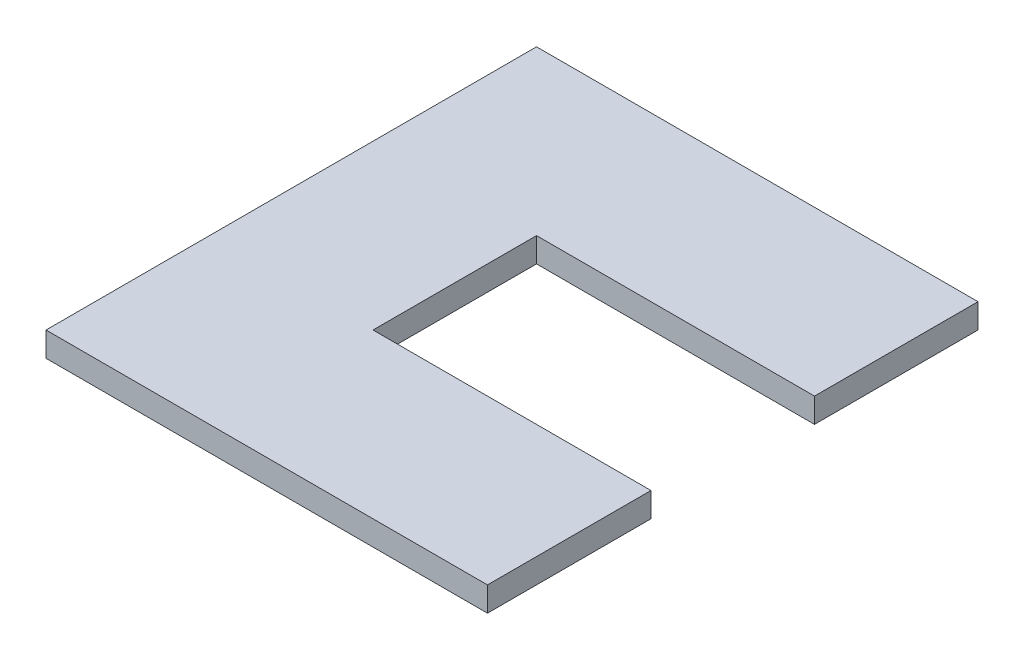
ISO-10303-21;
HEADER;
FILE_DESCRIPTION(('STEP AP214'),'2;1');
FILE_NAME('part.step','',(''),(''),'','','');
FILE_SCHEMA(('AUTOMOTIVE_DESIGN { 1 0 10303 214 1 1 1 1 }'));
ENDSEC;
DATA;
#1=APPLICATION_CONTEXT('core data for automotive mechanical design processes');
#2=APPLICATION_PROTOCOL_DEFINITION('international standard','automotive_design',2000,#1);
#3=PRODUCT_CONTEXT('',#1,'mechanical');
#4=PRODUCT('Part','Part','',(#3));
#5=PRODUCT_RELATED_PRODUCT_CATEGORY('part','',(#4));
#6=PRODUCT_DEFINITION_FORMATION('','',#4);
#7=PRODUCT_DEFINITION_CONTEXT('part definition',#1,'design');
#8=PRODUCT_DEFINITION('design','',#6,#7);
#9=PRODUCT_DEFINITION_SHAPE('','',#8);
#10=(LENGTH_UNIT() NAMED_UNIT(*) SI_UNIT(.MILLI.,.METRE.));
#11=(NAMED_UNIT(*) PLANE_ANGLE_UNIT() SI_UNIT($,.RADIAN.));
#12=(NAMED_UNIT(*) SI_UNIT($,.STERADIAN.) SOLID_ANGLE_UNIT());
#13=UNCERTAINTY_MEASURE_WITH_UNIT(LENGTH_MEASURE(1.E-05),#10,'distance_accuracy_value','');
#14=(GEOMETRIC_REPRESENTATION_CONTEXT(3) GLOBAL_UNCERTAINTY_ASSIGNED_CONTEXT((#13)) GLOBAL_UNIT_ASSIGNED_CONTEXT((#10,
#11,#12)) REPRESENTATION_CONTEXT('',''));
#15=CARTESIAN_POINT('',(0.,0.,0.));
#16=DIRECTION('',(0.,0.,1.));
#17=DIRECTION('',(1.,0.,0.));
#18=AXIS2_PLACEMENT_3D('',#15,#16,#17);
#19=CARTESIAN_POINT('',(-4.50000000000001,-0.01,-15.));
#20=DIRECTION('',(-1.,0.,0.));
#21=DIRECTION('',(0.,0.,1.));
#22=AXIS2_PLACEMENT_3D('',#19,#20,#21);
#23=PLANE('',#22);
#24=DIRECTION('',(0.,1.,0.));
#25=VECTOR('',#24,1.);
#26=CARTESIAN_POINT('',(-4.50000000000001,1.5,-15.));
#27=LINE('',#26,#25);
#28=CARTESIAN_POINT('',(-4.50000000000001,0.,-15.));
#29=VERTEX_POINT('',#28);
#30=CARTESIAN_POINT('',(-4.50000000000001,1.5,-15.));
#31=VERTEX_POINT('',#30);
#32=EDGE_CURVE('E152',#29,#31,#27,.T.);
#33=ORIENTED_EDGE('',*,*,#32,.T.);
#34=DIRECTION('',(0.,0.,1.));
#35=VECTOR('',#34,1.);
#36=CARTESIAN_POINT('',(-4.5,1.5,0.));
#37=LINE('',#36,#35);
#38=CARTESIAN_POINT('',(-4.5,1.5,-5.));
#39=VERTEX_POINT('',#38);
#40=EDGE_CURVE('E128',#31,#39,#37,.T.);
#41=ORIENTED_EDGE('',*,*,#40,.T.);
#42=DIRECTION('',(0.,1.,0.));
#43=VECTOR('',#42,1.);
#44=CARTESIAN_POINT('',(-4.5,-0.01,-5.));
#45=LINE('',#44,#43);
#46=CARTESIAN_POINT('',(-4.5,0.,-5.));
#47=VERTEX_POINT('',#46);
#48=EDGE_CURVE('E139',#47,#39,#45,.T.);
#49=ORIENTED_EDGE('',*,*,#48,.F.);
#50=DIRECTION('',(0.,0.,1.));
#51=VECTOR('',#50,1.);
#52=CARTESIAN_POINT('',(-4.5,0.,0.));
#53=LINE('',#52,#51);
#54=EDGE_CURVE('E112',#29,#47,#53,.T.);
#55=ORIENTED_EDGE('',*,*,#54,.F.);
#56=EDGE_LOOP('',(#33,#41,#49,#55));
#57=FACE_BOUND('',#56,.T.);
#58=ADVANCED_FACE('F35',(#57),#23,.F.);
#59=CARTESIAN_POINT('',(-4.5,-0.01,15.));
#60=DIRECTION('',(-1.,0.,0.));
#61=DIRECTION('',(0.,0.,1.));
#62=AXIS2_PLACEMENT_3D('',#59,#60,#61);
#63=PLANE('',#62);
#64=DIRECTION('',(0.,1.,0.));
#65=VECTOR('',#64,1.);
#66=CARTESIAN_POINT('',(-4.5,-0.01,5.));
#67=LINE('',#66,#65);
#68=CARTESIAN_POINT('',(-4.5,0.,5.));
#69=VERTEX_POINT('',#68);
#70=CARTESIAN_POINT('',(-4.5,1.5,5.));
#71=VERTEX_POINT('',#70);
#72=EDGE_CURVE('E39',#69,#71,#67,.T.);
#73=ORIENTED_EDGE('',*,*,#72,.T.);
#74=DIRECTION('',(0.,0.,1.));
#75=VECTOR('',#74,1.);
#76=CARTESIAN_POINT('',(-4.5,1.5,0.));
#77=LINE('',#76,#75);
#78=CARTESIAN_POINT('',(-4.5,1.5,15.));
#79=VERTEX_POINT('',#78);
#80=EDGE_CURVE('E126',#71,#79,#77,.T.);
#81=ORIENTED_EDGE('',*,*,#80,.T.);
#82=DIRECTION('',(0.,1.,0.));
#83=VECTOR('',#82,1.);
#84=CARTESIAN_POINT('',(-4.5,1.5,15.));
#85=LINE('',#84,#83);
#86=CARTESIAN_POINT('',(-4.5,0.,15.));
#87=VERTEX_POINT('',#86);
#88=EDGE_CURVE('E110',#87,#79,#85,.T.);
#89=ORIENTED_EDGE('',*,*,#88,.F.);
#90=DIRECTION('',(0.,0.,1.));
#91=VECTOR('',#90,1.);
#92=CARTESIAN_POINT('',(-4.5,0.,0.));
#93=LINE('',#92,#91);
#94=EDGE_CURVE('E72',#69,#87,#93,.T.);
#95=ORIENTED_EDGE('',*,*,#94,.F.);
#96=EDGE_LOOP('',(#73,#81,#89,#95));
#97=FACE_BOUND('',#96,.T.);
#98=ADVANCED_FACE('F107',(#97),#63,.F.);
#99=CARTESIAN_POINT('',(-21.5,-0.01,-5.));
#100=DIRECTION('',(0.,0.,1.));
#101=DIRECTION('',(1.,0.,0.));
#102=AXIS2_PLACEMENT_3D('',#99,#100,#101);
#103=PLANE('',#102);
#104=DIRECTION('',(0.,1.,0.));
#105=VECTOR('',#104,1.);
#106=CARTESIAN_POINT('',(-21.5,-0.01,-5.));
#107=LINE('',#106,#105);
#108=CARTESIAN_POINT('',(-21.5,0.,-5.));
#109=VERTEX_POINT('',#108);
#110=CARTESIAN_POINT('',(-21.5,1.5,-5.));
#111=VERTEX_POINT('',#110);
#112=EDGE_CURVE('E11',#109,#111,#107,.T.);
#113=ORIENTED_EDGE('',*,*,#112,.F.);
#114=DIRECTION('',(1.,0.,0.));
#115=VECTOR('',#114,1.);
#116=CARTESIAN_POINT('',(0.,0.,-5.));
#117=LINE('',#116,#115);
#118=EDGE_CURVE('E120',#109,#47,#117,.T.);
#119=ORIENTED_EDGE('',*,*,#118,.T.);
#120=ORIENTED_EDGE('',*,*,#48,.T.);
#121=DIRECTION('',(1.,0.,0.));
#122=VECTOR('',#121,1.);
#123=CARTESIAN_POINT('',(0.,1.5,-5.));
#124=LINE('',#123,#122);
#125=EDGE_CURVE('E136',#111,#39,#124,.T.);
#126=ORIENTED_EDGE('',*,*,#125,.F.);
#127=EDGE_LOOP('',(#113,#119,#120,#126));
#128=FACE_BOUND('',#127,.T.);
#129=ADVANCED_FACE('F168',(#128),#103,.T.);
#130=CARTESIAN_POINT('',(-21.5,-0.01,5.));
#131=DIRECTION('',(1.,0.,0.));
#132=DIRECTION('',(0.,0.,-1.));
#133=AXIS2_PLACEMENT_3D('',#130,#131,#132);
#134=PLANE('',#133);
#135=DIRECTION('',(0.,1.,0.));
#136=VECTOR('',#135,1.);
#137=CARTESIAN_POINT('',(-21.5,-0.01,5.));
#138=LINE('',#137,#136);
#139=CARTESIAN_POINT('',(-21.5,0.,5.));
#140=VERTEX_POINT('',#139);
#141=CARTESIAN_POINT('',(-21.5,1.5,5.));
#142=VERTEX_POINT('',#141);
#143=EDGE_CURVE('E45',#140,#142,#138,.T.);
#144=ORIENTED_EDGE('',*,*,#143,.F.);
#145=DIRECTION('',(0.,0.,-1.));
#146=VECTOR('',#145,1.);
#147=CARTESIAN_POINT('',(-21.5,0.,0.));
#148=LINE('',#147,#146);
#149=EDGE_CURVE('E125',#140,#109,#148,.T.);
#150=ORIENTED_EDGE('',*,*,#149,.T.);
#151=ORIENTED_EDGE('',*,*,#112,.T.);
#152=DIRECTION('',(0.,0.,-1.));
#153=VECTOR('',#152,1.);
#154=CARTESIAN_POINT('',(-21.5,1.5,0.));
#155=LINE('',#154,#153);
#156=EDGE_CURVE('E133',#142,#111,#155,.T.);
#157=ORIENTED_EDGE('',*,*,#156,.F.);
#158=EDGE_LOOP('',(#144,#150,#151,#157));
#159=FACE_BOUND('',#158,.T.);
#160=ADVANCED_FACE('F170',(#159),#134,.T.);
#161=CARTESIAN_POINT('',(-21.5,-0.01,5.));
#162=DIRECTION('',(0.,0.,-1.));
#163=DIRECTION('',(-1.,0.,0.));
#164=AXIS2_PLACEMENT_3D('',#161,#162,#163);
#165=PLANE('',#164);
#166=ORIENTED_EDGE('',*,*,#72,.F.);
#167=DIRECTION('',(-1.,0.,0.));
#168=VECTOR('',#167,1.);
#169=CARTESIAN_POINT('',(0.,0.,5.));
#170=LINE('',#169,#168);
#171=EDGE_CURVE('E117',#69,#140,#170,.T.);
#172=ORIENTED_EDGE('',*,*,#171,.T.);
#173=ORIENTED_EDGE('',*,*,#143,.T.);
#174=DIRECTION('',(-1.,0.,0.));
#175=VECTOR('',#174,1.);
#176=CARTESIAN_POINT('',(0.,1.5,5.));
#177=LINE('',#176,#175);
#178=EDGE_CURVE('E119',#71,#142,#177,.T.);
#179=ORIENTED_EDGE('',*,*,#178,.F.);
#180=EDGE_LOOP('',(#166,#172,#173,#179));
#181=FACE_BOUND('',#180,.T.);
#182=ADVANCED_FACE('F116',(#181),#165,.T.);
#183=CARTESIAN_POINT('',(0.,1.5,-15.));
#184=DIRECTION('',(0.,0.,-1.));
#185=DIRECTION('',(-1.,0.,0.));
#186=AXIS2_PLACEMENT_3D('',#183,#184,#185);
#187=PLANE('',#186);
#188=ORIENTED_EDGE('',*,*,#32,.F.);
#189=DIRECTION('',(1.,0.,0.));
#190=VECTOR('',#189,1.);
#191=CARTESIAN_POINT('',(0.,0.,-15.));
#192=LINE('',#191,#190);
#193=CARTESIAN_POINT('',(-31.5,0.,-15.));
#194=VERTEX_POINT('',#193);
#195=EDGE_CURVE('E141',#194,#29,#192,.T.);
#196=ORIENTED_EDGE('',*,*,#195,.F.);
#197=DIRECTION('',(0.,-1.,0.));
#198=VECTOR('',#197,1.);
#199=CARTESIAN_POINT('',(-31.5,1.5,-15.));
#200=LINE('',#199,#198);
#201=CARTESIAN_POINT('',(-31.5,1.5,-15.));
#202=VERTEX_POINT('',#201);
#203=EDGE_CURVE('E54',#202,#194,#200,.T.);
#204=ORIENTED_EDGE('',*,*,#203,.F.);
#205=DIRECTION('',(1.,0.,0.));
#206=VECTOR('',#205,1.);
#207=CARTESIAN_POINT('',(0.,1.5,-15.));
#208=LINE('',#207,#206);
#209=EDGE_CURVE('E146',#202,#31,#208,.T.);
#210=ORIENTED_EDGE('',*,*,#209,.T.);
#211=EDGE_LOOP('',(#188,#196,#204,#210));
#212=FACE_BOUND('',#211,.T.);
#213=ADVANCED_FACE('F179',(#212),#187,.T.);
#214=CARTESIAN_POINT('',(-31.5,1.5,0.));
#215=DIRECTION('',(1.,0.,0.));
#216=DIRECTION('',(0.,0.,-1.));
#217=AXIS2_PLACEMENT_3D('',#214,#215,#216);
#218=PLANE('',#217);
#219=DIRECTION('',(0.,0.,1.));
#220=VECTOR('',#219,1.);
#221=CARTESIAN_POINT('',(-31.5,0.,0.));
#222=LINE('',#221,#220);
#223=CARTESIAN_POINT('',(-31.5,0.,15.));
#224=VERTEX_POINT('',#223);
#225=EDGE_CURVE('E145',#194,#224,#222,.T.);
#226=ORIENTED_EDGE('',*,*,#225,.T.);
#227=DIRECTION('',(0.,-1.,0.));
#228=VECTOR('',#227,1.);
#229=CARTESIAN_POINT('',(-31.5,1.5,15.));
#230=LINE('',#229,#228);
#231=CARTESIAN_POINT('',(-31.5,1.5,15.));
#232=VERTEX_POINT('',#231);
#233=EDGE_CURVE('E167',#232,#224,#230,.T.);
#234=ORIENTED_EDGE('',*,*,#233,.F.);
#235=DIRECTION('',(0.,0.,1.));
#236=VECTOR('',#235,1.);
#237=CARTESIAN_POINT('',(-31.5,1.5,0.));
#238=LINE('',#237,#236);
#239=EDGE_CURVE('E64',#202,#232,#238,.T.);
#240=ORIENTED_EDGE('',*,*,#239,.F.);
#241=ORIENTED_EDGE('',*,*,#203,.T.);
#242=EDGE_LOOP('',(#226,#234,#240,#241));
#243=FACE_BOUND('',#242,.T.);
#244=ADVANCED_FACE('F191',(#243),#218,.F.);
#245=CARTESIAN_POINT('',(0.,1.5,15.));
#246=DIRECTION('',(0.,0.,-1.));
#247=DIRECTION('',(-1.,0.,0.));
#248=AXIS2_PLACEMENT_3D('',#245,#246,#247);
#249=PLANE('',#248);
#250=DIRECTION('',(1.,0.,0.));
#251=VECTOR('',#250,1.);
#252=CARTESIAN_POINT('',(0.,0.,15.));
#253=LINE('',#252,#251);
#254=EDGE_CURVE('E144',#224,#87,#253,.T.);
#255=ORIENTED_EDGE('',*,*,#254,.T.);
#256=ORIENTED_EDGE('',*,*,#88,.T.);
#257=DIRECTION('',(1.,0.,0.));
#258=VECTOR('',#257,1.);
#259=CARTESIAN_POINT('',(0.,1.5,15.));
#260=LINE('',#259,#258);
#261=EDGE_CURVE('E149',#232,#79,#260,.T.);
#262=ORIENTED_EDGE('',*,*,#261,.F.);
#263=ORIENTED_EDGE('',*,*,#233,.T.);
#264=EDGE_LOOP('',(#255,#256,#262,#263));
#265=FACE_BOUND('',#264,.T.);
#266=ADVANCED_FACE('F173',(#265),#249,.F.);
#267=CARTESIAN_POINT('',(0.,0.,0.));
#268=DIRECTION('',(0.,1.,0.));
#269=DIRECTION('',(0.,0.,1.));
#270=AXIS2_PLACEMENT_3D('',#267,#268,#269);
#271=PLANE('',#270);
#272=ORIENTED_EDGE('',*,*,#171,.F.);
#273=ORIENTED_EDGE('',*,*,#94,.T.);
#274=ORIENTED_EDGE('',*,*,#254,.F.);
#275=ORIENTED_EDGE('',*,*,#225,.F.);
#276=ORIENTED_EDGE('',*,*,#195,.T.);
#277=ORIENTED_EDGE('',*,*,#54,.T.);
#278=ORIENTED_EDGE('',*,*,#118,.F.);
#279=ORIENTED_EDGE('',*,*,#149,.F.);
#280=EDGE_LOOP('',(#272,#273,#274,#275,#276,#277,#278,#279));
#281=FACE_BOUND('',#280,.T.);
#282=ADVANCED_FACE('F122',(#281),#271,.F.);
#283=CARTESIAN_POINT('',(0.,1.5,0.));
#284=DIRECTION('',(0.,1.,0.));
#285=DIRECTION('',(0.,0.,1.));
#286=AXIS2_PLACEMENT_3D('',#283,#284,#285);
#287=PLANE('',#286);
#288=ORIENTED_EDGE('',*,*,#80,.F.);
#289=ORIENTED_EDGE('',*,*,#178,.T.);
#290=ORIENTED_EDGE('',*,*,#156,.T.);
#291=ORIENTED_EDGE('',*,*,#125,.T.);
#292=ORIENTED_EDGE('',*,*,#40,.F.);
#293=ORIENTED_EDGE('',*,*,#209,.F.);
#294=ORIENTED_EDGE('',*,*,#239,.T.);
#295=ORIENTED_EDGE('',*,*,#261,.T.);
#296=EDGE_LOOP('',(#288,#289,#290,#291,#292,#293,#294,#295));
#297=FACE_BOUND('',#296,.T.);
#298=ADVANCED_FACE('F37',(#297),#287,.T.);
#299=CLOSED_SHELL('',(#58,#98,#129,#160,#182,#213,#244,#266,#282,#298));
#300=MANIFOLD_SOLID_BREP('B2',#299);
#301=ADVANCED_BREP_SHAPE_REPRESENTATION('',(#18,#300),#14);
#302=SHAPE_DEFINITION_REPRESENTATION(#9,#301);
ENDSEC;
END-ISO-10303-21;
